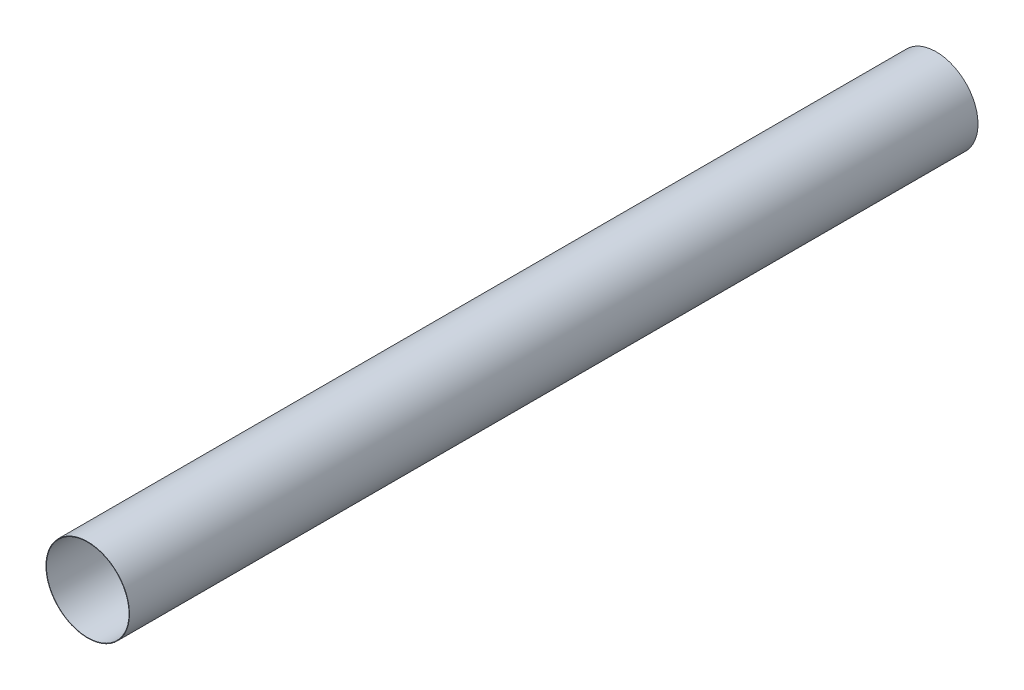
ISO-10303-21;
HEADER;
FILE_DESCRIPTION(('STEP AP214'),'2;1');
FILE_NAME('part.step','',(''),(''),'','','');
FILE_SCHEMA(('AUTOMOTIVE_DESIGN { 1 0 10303 214 1 1 1 1 }'));
ENDSEC;
DATA;
#1=APPLICATION_CONTEXT('core data for automotive mechanical design processes');
#2=APPLICATION_PROTOCOL_DEFINITION('international standard','automotive_design',2000,#1);
#3=PRODUCT_CONTEXT('',#1,'mechanical');
#4=PRODUCT('Part','Part','',(#3));
#5=PRODUCT_RELATED_PRODUCT_CATEGORY('part','',(#4));
#6=PRODUCT_DEFINITION_FORMATION('','',#4);
#7=PRODUCT_DEFINITION_CONTEXT('part definition',#1,'design');
#8=PRODUCT_DEFINITION('design','',#6,#7);
#9=PRODUCT_DEFINITION_SHAPE('','',#8);
#10=(LENGTH_UNIT() NAMED_UNIT(*) SI_UNIT(.MILLI.,.METRE.));
#11=(NAMED_UNIT(*) PLANE_ANGLE_UNIT() SI_UNIT($,.RADIAN.));
#12=(NAMED_UNIT(*) SI_UNIT($,.STERADIAN.) SOLID_ANGLE_UNIT());
#13=UNCERTAINTY_MEASURE_WITH_UNIT(LENGTH_MEASURE(1.E-05),#10,'distance_accuracy_value','');
#14=(GEOMETRIC_REPRESENTATION_CONTEXT(3) GLOBAL_UNCERTAINTY_ASSIGNED_CONTEXT((#13)) GLOBAL_UNIT_ASSIGNED_CONTEXT((#10,
#11,#12)) REPRESENTATION_CONTEXT('',''));
#15=CARTESIAN_POINT('',(0.,0.,0.));
#16=DIRECTION('',(0.,0.,1.));
#17=DIRECTION('',(1.,0.,0.));
#18=AXIS2_PLACEMENT_3D('',#15,#16,#17);
#19=CARTESIAN_POINT('',(0.,0.,-390.));
#20=DIRECTION('',(0.,0.,1.));
#21=DIRECTION('',(1.,0.,0.));
#22=AXIS2_PLACEMENT_3D('',#19,#20,#21);
#23=CYLINDRICAL_SURFACE('',#22,19.2);
#24=CARTESIAN_POINT('',(0.,0.,-390.));
#25=DIRECTION('',(0.,0.,1.));
#26=DIRECTION('',(1.,0.,0.));
#27=AXIS2_PLACEMENT_3D('',#24,#25,#26);
#28=CIRCLE('',#27,19.2);
#29=CARTESIAN_POINT('',(19.2,0.,-390.));
#30=VERTEX_POINT('',#29);
#31=EDGE_CURVE('E10',#30,#30,#28,.T.);
#32=ORIENTED_EDGE('',*,*,#31,.T.);
#33=EDGE_LOOP('',(#32));
#34=FACE_BOUND('',#33,.T.);
#35=CARTESIAN_POINT('',(0.,0.,0.));
#36=DIRECTION('',(0.,0.,1.));
#37=DIRECTION('',(1.,0.,0.));
#38=AXIS2_PLACEMENT_3D('',#35,#36,#37);
#39=CIRCLE('',#38,19.2);
#40=CARTESIAN_POINT('',(19.2,0.,0.));
#41=VERTEX_POINT('',#40);
#42=EDGE_CURVE('E40',#41,#41,#39,.T.);
#43=ORIENTED_EDGE('',*,*,#42,.F.);
#44=EDGE_LOOP('',(#43));
#45=FACE_BOUND('',#44,.T.);
#46=ADVANCED_FACE('F37',(#34,#45),#23,.T.);
#47=CARTESIAN_POINT('',(0.,0.,-390.));
#48=DIRECTION('',(0.,0.,1.));
#49=DIRECTION('',(1.,0.,0.));
#50=AXIS2_PLACEMENT_3D('',#47,#48,#49);
#51=PLANE('',#50);
#52=CARTESIAN_POINT('',(0.,0.,-390.));
#53=DIRECTION('',(0.,0.,1.));
#54=DIRECTION('',(1.,0.,0.));
#55=AXIS2_PLACEMENT_3D('',#52,#53,#54);
#56=CIRCLE('',#55,19.);
#57=CARTESIAN_POINT('',(19.,0.,-390.));
#58=VERTEX_POINT('',#57);
#59=EDGE_CURVE('E47',#58,#58,#56,.T.);
#60=ORIENTED_EDGE('',*,*,#59,.T.);
#61=EDGE_LOOP('',(#60));
#62=FACE_BOUND('',#61,.T.);
#63=ORIENTED_EDGE('',*,*,#31,.F.);
#64=EDGE_LOOP('',(#63));
#65=FACE_BOUND('',#64,.T.);
#66=ADVANCED_FACE('F55',(#62,#65),#51,.F.);
#67=CARTESIAN_POINT('',(0.,0.,0.));
#68=DIRECTION('',(0.,0.,1.));
#69=DIRECTION('',(1.,0.,0.));
#70=AXIS2_PLACEMENT_3D('',#67,#68,#69);
#71=PLANE('',#70);
#72=CARTESIAN_POINT('',(0.,0.,0.));
#73=DIRECTION('',(0.,0.,1.));
#74=DIRECTION('',(1.,0.,0.));
#75=AXIS2_PLACEMENT_3D('',#72,#73,#74);
#76=CIRCLE('',#75,19.);
#77=CARTESIAN_POINT('',(19.,0.,0.));
#78=VERTEX_POINT('',#77);
#79=EDGE_CURVE('E49',#78,#78,#76,.T.);
#80=ORIENTED_EDGE('',*,*,#79,.F.);
#81=EDGE_LOOP('',(#80));
#82=FACE_BOUND('',#81,.T.);
#83=ORIENTED_EDGE('',*,*,#42,.T.);
#84=EDGE_LOOP('',(#83));
#85=FACE_BOUND('',#84,.T.);
#86=ADVANCED_FACE('F61',(#82,#85),#71,.T.);
#87=CARTESIAN_POINT('',(0.,0.,-390.));
#88=DIRECTION('',(0.,0.,1.));
#89=DIRECTION('',(1.,0.,0.));
#90=AXIS2_PLACEMENT_3D('',#87,#88,#89);
#91=CYLINDRICAL_SURFACE('',#90,19.);
#92=ORIENTED_EDGE('',*,*,#59,.F.);
#93=EDGE_LOOP('',(#92));
#94=FACE_BOUND('',#93,.T.);
#95=ORIENTED_EDGE('',*,*,#79,.T.);
#96=EDGE_LOOP('',(#95));
#97=FACE_BOUND('',#96,.T.);
#98=ADVANCED_FACE('F58',(#94,#97),#91,.F.);
#99=CLOSED_SHELL('',(#46,#66,#86,#98));
#100=MANIFOLD_SOLID_BREP('B2',#99);
#101=ADVANCED_BREP_SHAPE_REPRESENTATION('',(#18,#100),#14);
#102=SHAPE_DEFINITION_REPRESENTATION(#9,#101);
ENDSEC;
END-ISO-10303-21;
